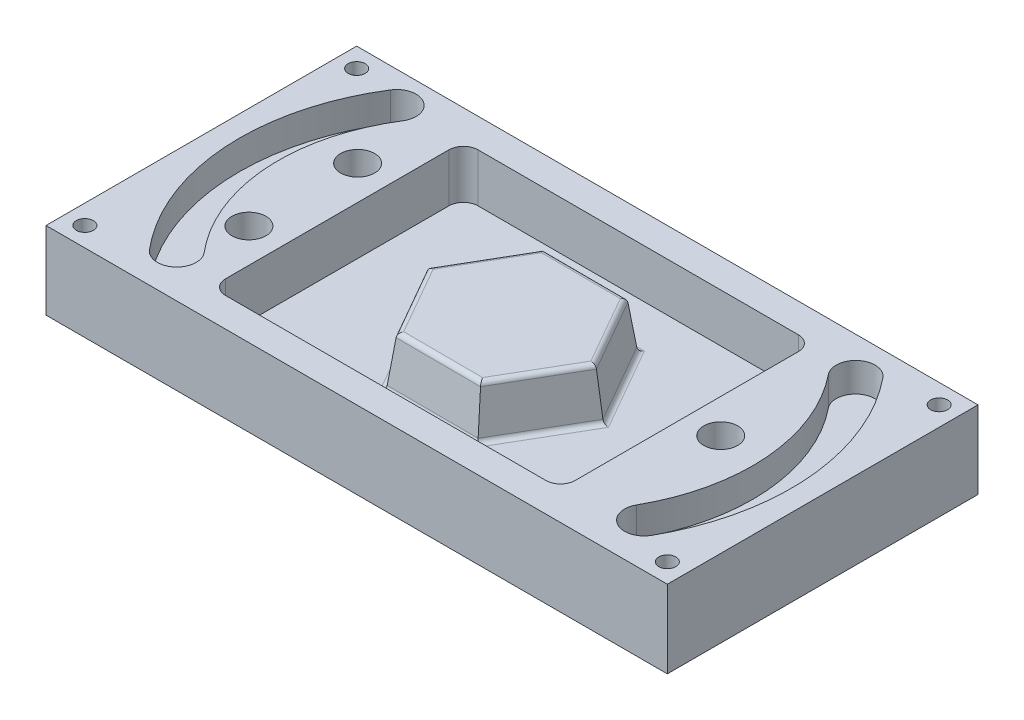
from build123d import *

# Parameters (mm, degrees)
SKETCH1_W           = 406.4
SKETCH1_H           = 203.2
BOSS_EXTRUDE1_DEPTH = 50.8
CUT_EXTRUDE1_DEPTH  = 19.05
SKETCH8_W           = 228.6
SKETCH8_H           = 165.1
CUT_EXTRUDE3_DEPTH  = 31.75
DRAFT3_ANGLE        = 8
FILLET1_R           = 3.175
FILLET2_R           = 3.175
FILLET3_R           = 9.525
SKETCH9_R           = 5.55625
SKETCH9_R_2         = 11.1125
CUT_EXTRUDE4_DEPTH  = 233.794845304


with BuildPart() as part:
    # Sketch1 → Boss-Extrude1 (new body)
    with BuildSketch(Plane(origin=(0, 0, 0), x_dir=(1, 0, 0), z_dir=(0, 1, 0))):
        Rectangle(SKETCH1_W, SKETCH1_H)
    extrude(amount=BOSS_EXTRUDE1_DEPTH)

    # Sketch3 → Cut-Extrude1 (cut)
    with BuildSketch(Plane(origin=(0, 50.8, 0), x_dir=(1, 0, 0), z_dir=(0, 1, 0))):
        with BuildLine():
            ThreePointArc((-167.318438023, 87.903999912), (-189.109349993, 1.244075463), (-155.558614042, -81.575816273))
            ThreePointArc((-155.558614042, -81.575816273), (-137.662756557, -83.098407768), (-136.140165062, -65.202550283))
            ThreePointArc((-136.140165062, -65.202550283), (-163.770276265, 3.002296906), (-145.824758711, 74.369534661))
            ThreePointArc((-145.824758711, 74.369534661), (-149.804365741, 91.883606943), (-167.318438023, 87.903999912))
        make_face()
        with BuildLine():
            ThreePointArc((170.346445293, -79.191100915), (188.961219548, 5.339369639), (156.883362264, 85.73166619))
            ThreePointArc((156.883362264, 85.73166619), (139.026593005, 87.659305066), (137.098954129, 69.802535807))
            ThreePointArc((137.098954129, 69.802535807), (163.645430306, 3.272774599), (148.240515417, -66.681589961))
            ThreePointArc((148.240515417, -66.681589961), (153.038724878, -83.989310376), (170.346445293, -79.191100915))
        make_face()
    extrude(amount=-CUT_EXTRUDE1_DEPTH, mode=Mode.SUBTRACT)

    # Sketch8 → Cut-Extrude3 (cut)
    with BuildSketch(Plane(origin=(0, 50.8, 0), x_dir=(1, 0, 0), z_dir=(0, 1, 0))):
        Rectangle(SKETCH8_W, SKETCH8_H)
        Polygon((27.316297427, -47.728475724), (54.992221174, -0.207630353), (27.675923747, 47.520845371), (-27.316297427, 47.728475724), (-54.992221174, 0.207630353), (-27.675923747, -47.520845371), align=None, mode=Mode.SUBTRACT)
    extrude(amount=-CUT_EXTRUDE3_DEPTH, mode=Mode.SUBTRACT)

    # Draft3
    draft3_faces = [part.faces().sort_by_distance(p)[0] for p in [
        (-41.334072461, 34.925, 23.656607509),
        (-41.1542593, 34.925, -23.968053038),
        (0.17981316, 34.925, -47.624660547),
        (41.334072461, 34.925, -23.656607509),
        (41.1542593, 34.925, 23.968053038),
        (-0.17981316, 34.925, 47.624660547),
    ]]
    draft(draft3_faces, Plane(origin=(-203.2, 50.8, 101.6), x_dir=(0, 0, 1), z_dir=(0, 1, 0)), DRAFT3_ANGLE)

    # Fillet1
    fillet1_edges = [part.edges().sort_by_distance(p)[0] for p in [
        (-0.17981316, 50.8, 47.624660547),
        (-41.334072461, 50.8, 23.656607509),
        (-41.1542593, 50.8, -23.968053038),
        (0.17981316, 50.8, -47.624660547),
        (41.334072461, 50.8, -23.656607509),
        (41.1542593, 50.8, 23.968053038),
    ]]
    fillet(fillet1_edges, radius=FILLET1_R)

    # Fillet2
    fillet2_edges = [part.edges().sort_by_distance(p)[0] for p in [
        (-45.206822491, 19.05, 25.873087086),
        (-0.196660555, 19.05, 52.086800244),
        (45.010161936, 19.05, 26.213713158),
        (45.206822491, 19.05, -25.873087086),
        (0.196660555, 19.05, -52.086800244),
        (-45.010161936, 19.05, -26.213713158),
    ]]
    fillet(fillet2_edges, radius=FILLET2_R)

    # Fillet3
    fillet3_edges = [part.edges().sort_by_distance(p)[0] for p in [
        (-114.3, 34.925, 82.55),
        (-114.3, 34.925, -82.55),
        (114.3, 34.925, -82.55),
        (114.3, 34.925, 82.55),
    ]]
    fillet(fillet3_edges, radius=FILLET3_R)

    # Sketch9 → Cut-Extrude4 (cut, through all)
    with BuildSketch(Plane(origin=(0, 50.8, 0), x_dir=(1, 0, 0), z_dir=(0, 1, 0))):
        with Locations(Location((-190.5, 88.9, 0), (0, 0, 270))):
            Circle(SKETCH9_R)
        with Locations(Location((-190.5, -88.9, 0), (0, 0, 270))):
            Circle(SKETCH9_R)
        with Locations(Location((190.5, -88.9, 0), (0, 0, 270))):
            Circle(SKETCH9_R)
        with Locations(Location((190.5, 88.9, 0), (0, 0, 270))):
            Circle(SKETCH9_R)
        with Locations(Location((-136.525, 35.56, 0), (0, 0, 270))):
            Circle(SKETCH9_R_2)
        with Locations(Location((-136.525, -35.56, 0), (0, 0, 270))):
            Circle(SKETCH9_R_2)
        with Locations(Location((136.525, 0, 0), (0, 0, 270))):
            Circle(SKETCH9_R_2)
    extrude(amount=-CUT_EXTRUDE4_DEPTH, mode=Mode.SUBTRACT)


solid = part.part
